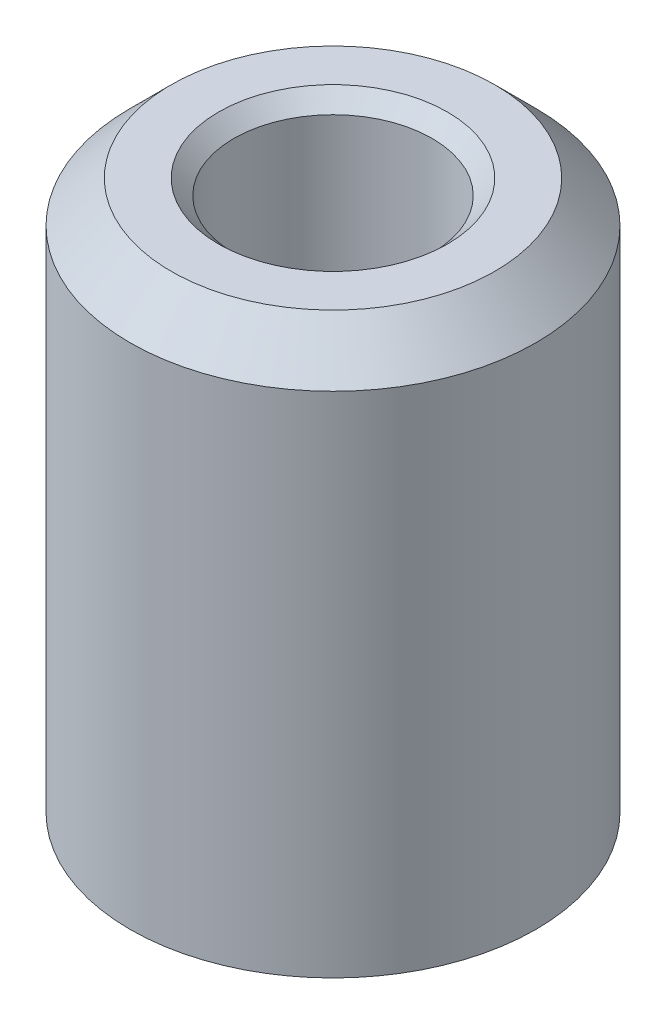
from build123d import *

# Parameters (mm, degrees)
SKICA1_R                 = 6.65
P_IDAT_VYSUNUT_M1_DEPTH  = 18
ZKOSEN_1_SIZE            = 1.35
SKICA2_R                 = 3.25
ODEBRAT_VYSUNUT_M1_DEPTH = 21.30874196
ZKOSEN_2_SIZE            = 0.5


with BuildPart() as part:
    # Skica1 → P_idat vysunut_m1 (new body)
    with BuildSketch(Plane(origin=(0, 0, 0), x_dir=(1, 0, 0), z_dir=(0, 1, 0))):
        with Locations(Location((0, 0, 0), (0, 0, 270))):
            Circle(SKICA1_R)
    extrude(amount=P_IDAT_VYSUNUT_M1_DEPTH)

    # Zkosen_1
    zkosen_1_edges = [part.edges().sort_by_distance(p)[0] for p in [
        (0, 18, -6.65),
    ]]
    chamfer(zkosen_1_edges, length=ZKOSEN_1_SIZE)

    # Skica2 → Odebrat vysunut_m1 (cut, through all)
    with BuildSketch(Plane(origin=(0, 18, 0), x_dir=(1, 0, 0), z_dir=(0, 1, 0))):
        with Locations(Location((0, 0, 0), (0, 0, 270))):
            Circle(SKICA2_R)
    extrude(amount=-ODEBRAT_VYSUNUT_M1_DEPTH, mode=Mode.SUBTRACT)

    # Zkosen_2
    zkosen_2_edges = [part.edges().sort_by_distance(p)[0] for p in [
        (0, 18, -3.25),
    ]]
    chamfer(zkosen_2_edges, length=ZKOSEN_2_SIZE)


solid = part.part
